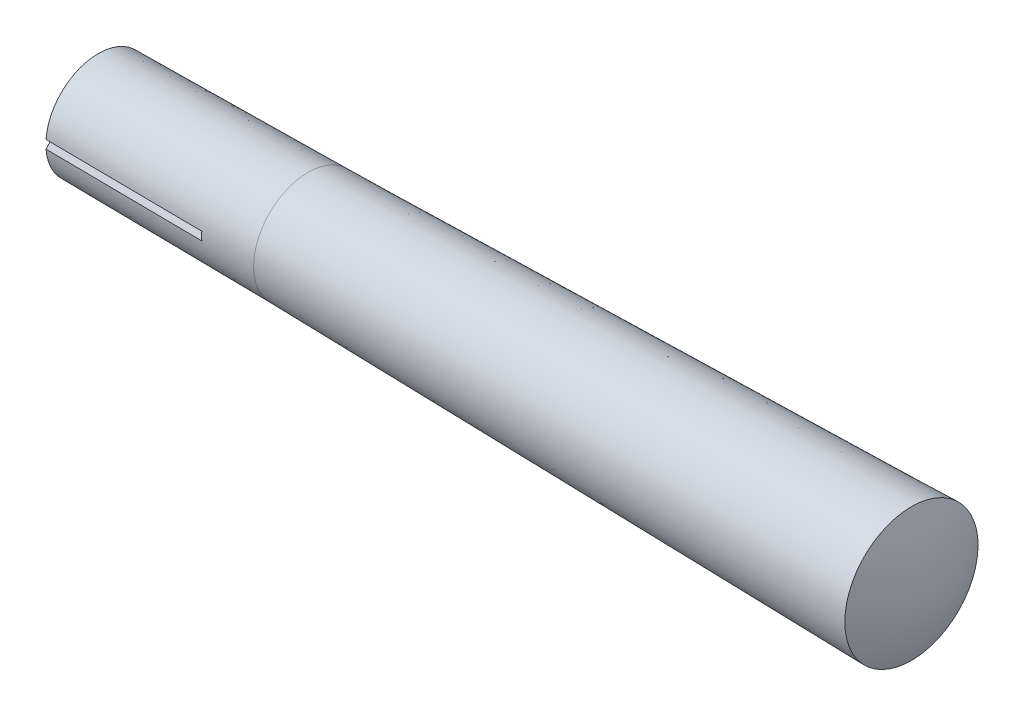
ISO-10303-21;
HEADER;
FILE_DESCRIPTION(('STEP AP214'),'2;1');
FILE_NAME('part.step','',(''),(''),'','','');
FILE_SCHEMA(('AUTOMOTIVE_DESIGN { 1 0 10303 214 1 1 1 1 }'));
ENDSEC;
DATA;
#1=APPLICATION_CONTEXT('core data for automotive mechanical design processes');
#2=APPLICATION_PROTOCOL_DEFINITION('international standard','automotive_design',2000,#1);
#3=PRODUCT_CONTEXT('',#1,'mechanical');
#4=PRODUCT('Part','Part','',(#3));
#5=PRODUCT_RELATED_PRODUCT_CATEGORY('part','',(#4));
#6=PRODUCT_DEFINITION_FORMATION('','',#4);
#7=PRODUCT_DEFINITION_CONTEXT('part definition',#1,'design');
#8=PRODUCT_DEFINITION('design','',#6,#7);
#9=PRODUCT_DEFINITION_SHAPE('','',#8);
#10=(LENGTH_UNIT() NAMED_UNIT(*) SI_UNIT(.MILLI.,.METRE.));
#11=(NAMED_UNIT(*) PLANE_ANGLE_UNIT() SI_UNIT($,.RADIAN.));
#12=(NAMED_UNIT(*) SI_UNIT($,.STERADIAN.) SOLID_ANGLE_UNIT());
#13=UNCERTAINTY_MEASURE_WITH_UNIT(LENGTH_MEASURE(1.E-05),#10,'distance_accuracy_value','');
#14=(GEOMETRIC_REPRESENTATION_CONTEXT(3) GLOBAL_UNCERTAINTY_ASSIGNED_CONTEXT((#13)) GLOBAL_UNIT_ASSIGNED_CONTEXT((#10,
#11,#12)) REPRESENTATION_CONTEXT('',''));
#15=CARTESIAN_POINT('',(0.,0.,0.));
#16=DIRECTION('',(0.,0.,1.));
#17=DIRECTION('',(1.,0.,0.));
#18=AXIS2_PLACEMENT_3D('',#15,#16,#17);
#19=CARTESIAN_POINT('',(17.4975488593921,0.,0.));
#20=DIRECTION('',(-1.,0.,0.));
#21=DIRECTION('',(0.,0.,1.));
#22=AXIS2_PLACEMENT_3D('',#19,#20,#21);
#23=DEGENERATE_TOROIDAL_SURFACE('',#22,0.313112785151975,20.,.T.);
#24=CARTESIAN_POINT('',(0.,0.,0.));
#25=DIRECTION('',(-1.,0.,0.));
#26=DIRECTION('',(0.,0.,1.));
#27=AXIS2_PLACEMENT_3D('',#24,#25,#26);
#28=CIRCLE('',#27,10.);
#29=CARTESIAN_POINT('',(0.,0.799999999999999,9.96794863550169));
#30=VERTEX_POINT('',#29);
#31=CARTESIAN_POINT('',(0.,0.800000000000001,-9.96794863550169));
#32=VERTEX_POINT('',#31);
#33=EDGE_CURVE('E101',#30,#32,#28,.T.);
#34=ORIENTED_EDGE('',*,*,#33,.T.);
#35=CARTESIAN_POINT('',(-2.49652378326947,0.8,0.));
#36=CARTESIAN_POINT('',(-2.49652432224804,0.8,0.133371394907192));
#37=CARTESIAN_POINT('',(-2.49574079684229,0.8,0.266735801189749));
#38=CARTESIAN_POINT('',(-2.49225916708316,0.8,0.533450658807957));
#39=CARTESIAN_POINT('',(-2.48956098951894,0.8,0.666801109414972));
#40=CARTESIAN_POINT('',(-2.48183007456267,0.8,0.933885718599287));
#41=CARTESIAN_POINT('',(-2.47678949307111,0.8,1.06761965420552));
#42=CARTESIAN_POINT('',(-2.46419580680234,0.8,1.33496952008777));
#43=CARTESIAN_POINT('',(-2.45664267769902,0.8,1.4685854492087));
#44=CARTESIAN_POINT('',(-2.43008825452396,0.8,1.86918413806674));
#45=CARTESIAN_POINT('',(-2.40719186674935,0.8,2.13591991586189));
#46=CARTESIAN_POINT('',(-2.35079475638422,0.8,2.66848639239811));
#47=CARTESIAN_POINT('',(-2.31728549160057,0.8,2.93431618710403));
#48=CARTESIAN_POINT('',(-2.23966533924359,0.8,3.46444745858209));
#49=CARTESIAN_POINT('',(-2.19555267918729,0.799999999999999,3.72874867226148));
#50=CARTESIAN_POINT('',(-2.04613311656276,0.799999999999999,4.52519992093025));
#51=CARTESIAN_POINT('',(-1.92442685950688,0.799999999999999,5.05441151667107));
#52=CARTESIAN_POINT('',(-1.70995864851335,0.799999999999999,5.83936475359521));
#53=CARTESIAN_POINT('',(-1.63313069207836,0.799999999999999,6.0995947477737));
#54=CARTESIAN_POINT('',(-1.46893599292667,0.799999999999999,6.61677714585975));
#55=CARTESIAN_POINT('',(-1.38156703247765,0.799999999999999,6.87372884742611));
#56=CARTESIAN_POINT('',(-1.10365696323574,0.799999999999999,7.6395207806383));
#57=CARTESIAN_POINT('',(-0.897457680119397,0.799999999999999,8.14276717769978));
#58=CARTESIAN_POINT('',(-0.444736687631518,0.799999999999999,9.13079494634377));
#59=CARTESIAN_POINT('',(-0.198214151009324,0.799999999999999,9.61557593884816));
#60=CARTESIAN_POINT('',(0.205178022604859,0.799999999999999,10.3347096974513));
#61=CARTESIAN_POINT('',(0.347936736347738,0.799999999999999,10.5770685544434));
#62=CARTESIAN_POINT('',(0.643513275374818,0.799999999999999,11.055488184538));
#63=CARTESIAN_POINT('',(0.796328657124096,0.799999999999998,11.2915504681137));
#64=CARTESIAN_POINT('',(1.26956012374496,0.799999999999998,11.9898041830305));
#65=CARTESIAN_POINT('',(1.60477707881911,0.799999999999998,12.4420901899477));
#66=CARTESIAN_POINT('',(2.31200697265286,0.799999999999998,13.3165963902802));
#67=CARTESIAN_POINT('',(2.68400905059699,0.799999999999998,13.7388253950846));
#68=CARTESIAN_POINT('',(3.46228921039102,0.799999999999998,14.5504331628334));
#69=CARTESIAN_POINT('',(3.86856689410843,0.799999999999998,14.9398123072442));
#70=CARTESIAN_POINT('',(4.71222453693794,0.799999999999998,15.6826920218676));
#71=CARTESIAN_POINT('',(5.14958426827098,0.799999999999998,16.0362155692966));
#72=CARTESIAN_POINT('',(6.05253330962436,0.799999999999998,16.7051626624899));
#73=CARTESIAN_POINT('',(6.51812268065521,0.799999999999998,17.020586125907));
#74=CARTESIAN_POINT('',(7.47424959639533,0.799999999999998,17.6111065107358));
#75=CARTESIAN_POINT('',(7.96478873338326,0.799999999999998,17.8862008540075));
#76=CARTESIAN_POINT('',(8.96729980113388,0.799999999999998,18.3940829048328));
#77=CARTESIAN_POINT('',(9.47927172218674,0.799999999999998,18.6268706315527));
#78=CARTESIAN_POINT('',(10.5209617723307,0.799999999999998,19.048465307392));
#79=CARTESIAN_POINT('',(11.050678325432,0.799999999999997,19.2372761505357));
#80=CARTESIAN_POINT('',(12.1241346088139,0.799999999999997,19.5696010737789));
#81=CARTESIAN_POINT('',(12.6678743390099,0.799999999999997,19.7131151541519));
#82=CARTESIAN_POINT('',(13.765500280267,0.799999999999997,19.9538237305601));
#83=CARTESIAN_POINT('',(14.3193862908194,0.799999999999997,20.0510191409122));
#84=CARTESIAN_POINT('',(15.4333774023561,0.799999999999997,20.1984035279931));
#85=CARTESIAN_POINT('',(15.9934825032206,0.799999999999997,20.2485925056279));
#86=CARTESIAN_POINT('',(17.1159178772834,0.799999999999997,20.3016066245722));
#87=CARTESIAN_POINT('',(17.6782481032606,0.799999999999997,20.3044327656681));
#88=CARTESIAN_POINT('',(18.8011477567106,0.799999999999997,20.2627036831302));
#89=CARTESIAN_POINT('',(19.3617171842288,0.799999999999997,20.2181484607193));
#90=CARTESIAN_POINT('',(20.4771283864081,0.799999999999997,20.0819711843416));
#91=CARTESIAN_POINT('',(21.0319699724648,0.799999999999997,19.990347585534));
#92=CARTESIAN_POINT('',(22.1319621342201,0.799999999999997,19.7606841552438));
#93=CARTESIAN_POINT('',(22.6771127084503,0.799999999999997,19.6226443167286));
#94=CARTESIAN_POINT('',(23.753871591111,0.799999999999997,19.3011225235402));
#95=CARTESIAN_POINT('',(24.2854792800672,0.799999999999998,19.117638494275));
#96=CARTESIAN_POINT('',(25.3313465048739,0.799999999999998,18.7065363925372));
#97=CARTESIAN_POINT('',(25.8456060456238,0.799999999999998,18.478918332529));
#98=CARTESIAN_POINT('',(26.8530566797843,0.799999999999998,17.9811981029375));
#99=CARTESIAN_POINT('',(27.3462504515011,0.799999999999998,17.7111013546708));
#100=CARTESIAN_POINT('',(28.3081327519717,0.799999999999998,17.1303242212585));
#101=CARTESIAN_POINT('',(28.7768212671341,0.799999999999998,16.8196438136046));
#102=CARTESIAN_POINT('',(29.6862924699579,0.799999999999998,16.1599557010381));
#103=CARTESIAN_POINT('',(30.1270796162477,0.799999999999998,15.8109541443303));
#104=CARTESIAN_POINT('',(30.97768189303,0.799999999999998,15.077084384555));
#105=CARTESIAN_POINT('',(31.3874970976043,0.799999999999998,14.6922162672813));
#106=CARTESIAN_POINT('',(32.173483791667,0.799999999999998,13.8890869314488));
#107=CARTESIAN_POINT('',(32.5496395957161,0.799999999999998,13.4708103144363));
#108=CARTESIAN_POINT('',(33.0863346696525,0.799999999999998,12.8208857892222));
#109=CARTESIAN_POINT('',(33.2606514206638,0.799999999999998,12.6004808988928));
#110=CARTESIAN_POINT('',(33.5998857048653,0.799999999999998,12.152461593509));
#111=CARTESIAN_POINT('',(33.7648008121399,0.799999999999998,11.9248453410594));
#112=CARTESIAN_POINT('',(34.2450384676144,0.799999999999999,11.2316916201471));
#113=CARTESIAN_POINT('',(34.5457800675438,0.799999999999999,10.7559379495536));
#114=CARTESIAN_POINT('',(35.1060738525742,0.799999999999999,9.78076711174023));
#115=CARTESIAN_POINT('',(35.3656261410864,0.799999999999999,9.28135000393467));
#116=CARTESIAN_POINT('',(35.7224861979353,0.799999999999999,8.51762358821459));
#117=CARTESIAN_POINT('',(35.8359708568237,0.799999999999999,8.26077021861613));
#118=CARTESIAN_POINT('',(36.0519976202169,0.799999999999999,7.74258165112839));
#119=CARTESIAN_POINT('',(36.1545424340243,0.799999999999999,7.48124758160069));
#120=CARTESIAN_POINT('',(36.4455469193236,0.799999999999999,6.69104432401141));
#121=CARTESIAN_POINT('',(36.6173960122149,0.799999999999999,6.15593260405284));
#122=CARTESIAN_POINT('',(36.8919965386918,0.799999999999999,5.15850154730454));
#123=CARTESIAN_POINT('',(37.0013654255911,0.799999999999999,4.69797559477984));
#124=CARTESIAN_POINT('',(37.1871913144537,0.799999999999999,3.77047016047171));
#125=CARTESIAN_POINT('',(37.2636631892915,0.8,3.30349369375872));
#126=CARTESIAN_POINT('',(37.3536072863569,0.8,2.59959399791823));
#127=CARTESIAN_POINT('',(37.3794729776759,0.8,2.3641834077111));
#128=CARTESIAN_POINT('',(37.4229504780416,0.8,1.89260512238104));
#129=CARTESIAN_POINT('',(37.4405629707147,0.8,1.65643749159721));
#130=CARTESIAN_POINT('',(37.4609542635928,0.8,1.30177924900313));
#131=CARTESIAN_POINT('',(37.4667477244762,0.8,1.18345199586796));
#132=CARTESIAN_POINT('',(37.4764027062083,0.8,0.946718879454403));
#133=CARTESIAN_POINT('',(37.4802642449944,0.8,0.828313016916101));
#134=CARTESIAN_POINT('',(37.486213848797,0.8,0.591438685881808));
#135=CARTESIAN_POINT('',(37.4883016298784,0.8,0.472970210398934));
#136=CARTESIAN_POINT('',(37.4910058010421,0.8,0.23601716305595));
#137=CARTESIAN_POINT('',(37.4916221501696,0.8,0.117532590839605));
#138=CARTESIAN_POINT('',(37.4916198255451,0.8,-0.298511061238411));
#139=CARTESIAN_POINT('',(37.4877271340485,0.8,-0.59609674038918));
#140=CARTESIAN_POINT('',(37.4729961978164,0.8,-1.04216106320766));
#141=CARTESIAN_POINT('',(37.4666046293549,0.8,-1.19078684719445));
#142=CARTESIAN_POINT('',(37.4506729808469,0.8,-1.48787008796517));
#143=CARTESIAN_POINT('',(37.441132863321,0.8,-1.63632754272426));
#144=CARTESIAN_POINT('',(37.4076775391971,0.8,-2.08116851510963));
#145=CARTESIAN_POINT('',(37.3789215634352,0.8,-2.37720445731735));
#146=CARTESIAN_POINT('',(37.308331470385,0.8,-2.96773997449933));
#147=CARTESIAN_POINT('',(37.2664957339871,0.8,-3.26223935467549));
#148=CARTESIAN_POINT('',(37.1698359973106,0.8,-3.84871616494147));
#149=CARTESIAN_POINT('',(37.1150288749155,0.800000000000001,-4.14069636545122));
#150=CARTESIAN_POINT('',(36.9924926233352,0.800000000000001,-4.7218963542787));
#151=CARTESIAN_POINT('',(36.9247640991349,0.800000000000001,-5.01111627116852));
#152=CARTESIAN_POINT('',(36.7022926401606,0.800000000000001,-5.87406854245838));
#153=CARTESIAN_POINT('',(36.5282863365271,0.800000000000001,-6.44295681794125));
#154=CARTESIAN_POINT('',(36.1321100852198,0.800000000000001,-7.5578503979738));
#155=CARTESIAN_POINT('',(35.9103941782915,0.800000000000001,-8.10401715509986));
#156=CARTESIAN_POINT('',(35.542434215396,0.800000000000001,-8.90678748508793));
#157=CARTESIAN_POINT('',(35.4138890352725,0.800000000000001,-9.17162074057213));
#158=CARTESIAN_POINT('',(35.1451950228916,0.800000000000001,-9.69542974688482));
#159=CARTESIAN_POINT('',(35.0050428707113,0.800000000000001,-9.95440379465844));
#160=CARTESIAN_POINT('',(34.567363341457,0.800000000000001,-10.7221072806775));
#161=CARTESIAN_POINT('',(34.2527859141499,0.800000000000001,-11.2212406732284));
#162=CARTESIAN_POINT('',(33.5807516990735,0.800000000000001,-12.1897443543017));
#163=CARTESIAN_POINT('',(33.2232957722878,0.800000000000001,-12.6591152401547));
#164=CARTESIAN_POINT('',(32.6658613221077,0.800000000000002,-13.3275821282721));
#165=CARTESIAN_POINT('',(32.4812755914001,0.800000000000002,-13.5396668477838));
#166=CARTESIAN_POINT('',(32.1033777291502,0.800000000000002,-13.9558061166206));
#167=CARTESIAN_POINT('',(31.9100680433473,0.800000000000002,-14.1598628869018));
#168=CARTESIAN_POINT('',(31.3174624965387,0.800000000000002,-14.7595410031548));
#169=CARTESIAN_POINT('',(30.905439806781,0.800000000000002,-15.1427305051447));
#170=CARTESIAN_POINT('',(30.0508524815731,0.800000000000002,-15.8727699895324));
#171=CARTESIAN_POINT('',(29.6083046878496,0.800000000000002,-16.2196397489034));
#172=CARTESIAN_POINT('',(28.6955427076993,0.800000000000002,-16.8748873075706));
#173=CARTESIAN_POINT('',(28.2253281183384,0.800000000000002,-17.1832645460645));
#174=CARTESIAN_POINT('',(27.2605909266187,0.800000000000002,-17.7593142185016));
#175=CARTESIAN_POINT('',(26.7660679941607,0.800000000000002,-18.0269860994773));
#176=CARTESIAN_POINT('',(25.7562326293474,0.800000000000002,-18.5197211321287));
#177=CARTESIAN_POINT('',(25.2409202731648,0.800000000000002,-18.7447844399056));
#178=CARTESIAN_POINT('',(24.1930805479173,0.800000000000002,-19.150736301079));
#179=CARTESIAN_POINT('',(23.6605503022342,0.800000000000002,-19.331617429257));
#180=CARTESIAN_POINT('',(22.5821430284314,0.800000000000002,-19.6478701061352));
#181=CARTESIAN_POINT('',(22.0362659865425,0.800000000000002,-19.7832416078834));
#182=CARTESIAN_POINT('',(20.9350958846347,0.800000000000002,-20.0075021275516));
#183=CARTESIAN_POINT('',(20.3798036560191,0.800000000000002,-20.0963952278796));
#184=CARTESIAN_POINT('',(19.263704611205,0.800000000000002,-20.2270849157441));
#185=CARTESIAN_POINT('',(18.7028977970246,0.800000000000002,-20.2688815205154));
#186=CARTESIAN_POINT('',(17.5797830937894,0.800000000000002,-20.3050802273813));
#187=CARTESIAN_POINT('',(17.0174752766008,0.800000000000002,-20.2994845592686));
#188=CARTESIAN_POINT('',(15.8953297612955,0.800000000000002,-20.2409438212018));
#189=CARTESIAN_POINT('',(15.3354920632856,0.800000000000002,-20.1879987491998));
#190=CARTESIAN_POINT('',(14.2222671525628,0.800000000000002,-20.0351356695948));
#191=CARTESIAN_POINT('',(13.6688799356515,0.800000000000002,-19.9352176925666));
#192=CARTESIAN_POINT('',(12.5724897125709,0.800000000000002,-19.6891192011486));
#193=CARTESIAN_POINT('',(12.0294867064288,0.800000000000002,-19.5429386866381));
#194=CARTESIAN_POINT('',(10.9577058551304,0.800000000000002,-19.205348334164));
#195=CARTESIAN_POINT('',(10.4289285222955,0.800000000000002,-19.0139368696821));
#196=CARTESIAN_POINT('',(9.38937867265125,0.800000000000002,-18.5872484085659));
#197=CARTESIAN_POINT('',(8.87860615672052,0.800000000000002,-18.3519714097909));
#198=CARTESIAN_POINT('',(7.87867052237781,0.800000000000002,-17.8392110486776));
#199=CARTESIAN_POINT('',(7.38950855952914,0.800000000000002,-17.561725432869));
#200=CARTESIAN_POINT('',(6.43630090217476,0.800000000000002,-16.9665301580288));
#201=CARTESIAN_POINT('',(5.97225521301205,0.800000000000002,-16.6488204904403));
#202=CARTESIAN_POINT('',(5.07264064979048,0.800000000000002,-15.975482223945));
#203=CARTESIAN_POINT('',(4.63706791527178,0.800000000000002,-15.6198587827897));
#204=CARTESIAN_POINT('',(3.79742677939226,0.800000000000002,-14.8731862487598));
#205=CARTESIAN_POINT('',(3.39335832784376,0.800000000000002,-14.4821372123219));
#206=CARTESIAN_POINT('',(2.61967763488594,0.800000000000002,-13.667478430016));
#207=CARTESIAN_POINT('',(2.25005820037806,0.800000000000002,-13.2438755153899));
#208=CARTESIAN_POINT('',(1.54780314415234,0.800000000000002,-12.3670449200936));
#209=CARTESIAN_POINT('',(1.21516775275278,0.800000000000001,-11.9138170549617));
#210=CARTESIAN_POINT('',(0.589058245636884,0.800000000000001,-10.9806812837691));
#211=CARTESIAN_POINT('',(0.295607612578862,0.800000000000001,-10.5007576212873));
#212=CARTESIAN_POINT('',(-0.24980662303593,0.800000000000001,-9.51790494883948));
#213=CARTESIAN_POINT('',(-0.501771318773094,0.800000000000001,-9.01497654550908));
#214=CARTESIAN_POINT('',(-0.962635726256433,0.800000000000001,-7.9892398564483));
#215=CARTESIAN_POINT('',(-1.17149809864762,0.800000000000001,-7.46641479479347));
#216=CARTESIAN_POINT('',(-1.54442877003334,0.800000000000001,-6.40495382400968));
#217=CARTESIAN_POINT('',(-1.70849184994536,0.800000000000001,-5.86631608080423));
#218=CARTESIAN_POINT('',(-1.990359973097,0.800000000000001,-4.77829430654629));
#219=CARTESIAN_POINT('',(-2.10826142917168,0.800000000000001,-4.22893521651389));
#220=CARTESIAN_POINT('',(-2.29749527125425,0.8,-3.12248330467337));
#221=CARTESIAN_POINT('',(-2.3688506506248,0.8,-2.56539444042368));
#222=CARTESIAN_POINT('',(-2.44572472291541,0.8,-1.6727855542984));
#223=CARTESIAN_POINT('',(-2.46618779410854,0.8,-1.3384755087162));
#224=CARTESIAN_POINT('',(-2.49158345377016,0.8,-0.669428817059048));
#225=CARTESIAN_POINT('',(-2.49652243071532,0.8,-0.334692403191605));
#226=CARTESIAN_POINT('',(-2.49652378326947,0.8,0.));
#227=B_SPLINE_CURVE_WITH_KNOTS('',3,(#35,#36,#37,#38,#39,#40,#41,#42,#43,#44,#45,#46,#47,#48,
#49,#50,#51,#52,#53,#54,#55,#56,#57,#58,#59,#60,#61,#62,#63,#64,#65,#66,#67,#68,#69,#70,#71,#72,
#73,#74,#75,#76,#77,#78,#79,#80,#81,#82,#83,#84,#85,#86,#87,#88,#89,#90,#91,#92,#93,#94,#95,#96,
#97,#98,#99,#100,#101,#102,#103,#104,#105,#106,#107,#108,#109,#110,#111,#112,#113,#114,#115,
#116,#117,#118,#119,#120,#121,#122,#123,#124,#125,#126,#127,#128,#129,#130,#131,#132,#133,#134,
#135,#136,#137,#138,#139,#140,#141,#142,#143,#144,#145,#146,#147,#148,#149,#150,#151,#152,#153,
#154,#155,#156,#157,#158,#159,#160,#161,#162,#163,#164,#165,#166,#167,#168,#169,#170,#171,#172,
#173,#174,#175,#176,#177,#178,#179,#180,#181,#182,#183,#184,#185,#186,#187,#188,#189,#190,#191,
#192,#193,#194,#195,#196,#197,#198,#199,#200,#201,#202,#203,#204,#205,#206,#207,#208,#209,#210,
#211,#212,#213,#214,#215,#216,#217,#218,#219,#220,#221,#222,#223,#224,#225,#226),.UNSPECIFIED.,
.T.,.F.,(4,2,2,2,2,2,2,2,2,2,2,2,2,2,2,2,2,2,2,2,2,2,2,2,2,2,2,2,2,2,2,2,2,2,2,2,2,2,2,2,2,2,2,
2,2,2,2,2,2,2,2,2,2,2,2,2,2,2,2,2,2,2,2,2,2,2,2,2,2,2,2,2,2,2,2,2,2,2,2,2,2,2,2,2,2,2,2,2,2,2,2,
2,2,2,2,4),(0.,0.400098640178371,0.800212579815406,1.2016761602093,1.60314362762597,
2.40607221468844,3.20964872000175,4.01335964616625,5.6402930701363,6.45411794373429,
7.26811433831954,8.89775246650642,10.527424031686,11.3710379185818,12.2144475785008,
13.9011718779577,15.5873996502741,17.2736078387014,18.9587285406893,20.6438528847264,
22.3290849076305,24.0143161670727,25.6993981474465,27.3844801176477,29.0695288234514,
30.7545774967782,32.4395906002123,34.1246036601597,35.8096720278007,37.494740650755,
39.1798862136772,40.8650313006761,42.5499614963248,44.2348926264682,45.919553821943,
47.6042109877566,49.289649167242,50.1324539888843,50.9754753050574,52.6618621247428,
54.3482447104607,55.1904445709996,56.0324353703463,57.7162800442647,59.1351995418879,
60.5534768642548,61.2638439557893,61.9741521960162,62.3295465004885,62.6849375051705,
63.0403853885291,63.3958431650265,64.288477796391,64.7347352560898,65.1809980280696,
66.0729723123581,66.9650570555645,67.8559873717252,68.7468759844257,70.5290670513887,
72.2949935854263,73.1778865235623,74.0610328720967,75.8285666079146,77.5960648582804,
78.4393337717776,79.2823677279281,80.9682006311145,82.6531107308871,84.3380453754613,
86.0230029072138,87.7079542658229,89.39318860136,91.0784246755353,92.7635127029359,
94.4486001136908,96.1336082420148,97.8186164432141,99.5036235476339,101.18863065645,
102.873698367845,104.558766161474,106.243923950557,107.929082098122,109.614011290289,
111.298937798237,112.983511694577,114.66809608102,116.353685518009,118.039230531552,
119.726229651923,121.413425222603,123.097077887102,124.779898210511,125.784349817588,
126.788388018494),.UNSPECIFIED.);
#228=EDGE_CURVE('E67',#32,#30,#227,.T.);
#229=ORIENTED_EDGE('',*,*,#228,.T.);
#230=EDGE_LOOP('',(#34,#229));
#231=FACE_BOUND('',#230,.T.);
#232=ADVANCED_FACE('F39',(#231),#23,.T.);
#233=CARTESIAN_POINT('',(0.,-0.799999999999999,-9.96794863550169));
#234=VERTEX_POINT('',#233);
#235=CARTESIAN_POINT('',(0.,-0.800000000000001,9.96794863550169));
#236=VERTEX_POINT('',#235);
#237=EDGE_CURVE('E104',#234,#236,#28,.T.);
#238=ORIENTED_EDGE('',*,*,#237,.T.);
#239=CARTESIAN_POINT('',(-2.49652378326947,-0.8,0.));
#240=CARTESIAN_POINT('',(-2.49652432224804,-0.8,-0.133371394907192));
#241=CARTESIAN_POINT('',(-2.49574079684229,-0.8,-0.266735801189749));
#242=CARTESIAN_POINT('',(-2.49225916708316,-0.8,-0.533450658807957));
#243=CARTESIAN_POINT('',(-2.48956098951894,-0.8,-0.666801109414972));
#244=CARTESIAN_POINT('',(-2.48183007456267,-0.8,-0.933885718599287));
#245=CARTESIAN_POINT('',(-2.47678949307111,-0.8,-1.06761965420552));
#246=CARTESIAN_POINT('',(-2.46419580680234,-0.8,-1.33496952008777));
#247=CARTESIAN_POINT('',(-2.45664267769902,-0.8,-1.4685854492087));
#248=CARTESIAN_POINT('',(-2.43008825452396,-0.8,-1.86918413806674));
#249=CARTESIAN_POINT('',(-2.40719186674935,-0.8,-2.13591991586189));
#250=CARTESIAN_POINT('',(-2.35079475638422,-0.8,-2.66848639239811));
#251=CARTESIAN_POINT('',(-2.31728549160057,-0.8,-2.93431618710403));
#252=CARTESIAN_POINT('',(-2.23966533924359,-0.8,-3.46444745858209));
#253=CARTESIAN_POINT('',(-2.19555267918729,-0.8,-3.72874867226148));
#254=CARTESIAN_POINT('',(-2.04613311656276,-0.8,-4.52519992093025));
#255=CARTESIAN_POINT('',(-1.92442685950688,-0.8,-5.05441151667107));
#256=CARTESIAN_POINT('',(-1.70995864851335,-0.799999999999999,-5.83936475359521));
#257=CARTESIAN_POINT('',(-1.63313069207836,-0.799999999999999,-6.0995947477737));
#258=CARTESIAN_POINT('',(-1.46893599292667,-0.799999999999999,-6.61677714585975));
#259=CARTESIAN_POINT('',(-1.38156703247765,-0.799999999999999,-6.87372884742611));
#260=CARTESIAN_POINT('',(-1.10365696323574,-0.799999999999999,-7.6395207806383));
#261=CARTESIAN_POINT('',(-0.897457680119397,-0.799999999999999,-8.14276717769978));
#262=CARTESIAN_POINT('',(-0.444736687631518,-0.799999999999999,-9.13079494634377));
#263=CARTESIAN_POINT('',(-0.198214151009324,-0.799999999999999,-9.61557593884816));
#264=CARTESIAN_POINT('',(0.205178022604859,-0.799999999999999,-10.3347096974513));
#265=CARTESIAN_POINT('',(0.347936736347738,-0.799999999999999,-10.5770685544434));
#266=CARTESIAN_POINT('',(0.643513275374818,-0.799999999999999,-11.055488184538));
#267=CARTESIAN_POINT('',(0.796328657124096,-0.799999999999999,-11.2915504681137));
#268=CARTESIAN_POINT('',(1.26956012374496,-0.799999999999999,-11.9898041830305));
#269=CARTESIAN_POINT('',(1.60477707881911,-0.799999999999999,-12.4420901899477));
#270=CARTESIAN_POINT('',(2.31200697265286,-0.799999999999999,-13.3165963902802));
#271=CARTESIAN_POINT('',(2.68400905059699,-0.799999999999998,-13.7388253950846));
#272=CARTESIAN_POINT('',(3.46228921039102,-0.799999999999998,-14.5504331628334));
#273=CARTESIAN_POINT('',(3.86856689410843,-0.799999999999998,-14.9398123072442));
#274=CARTESIAN_POINT('',(4.71222453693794,-0.799999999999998,-15.6826920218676));
#275=CARTESIAN_POINT('',(5.14958426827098,-0.799999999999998,-16.0362155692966));
#276=CARTESIAN_POINT('',(6.05253330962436,-0.799999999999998,-16.7051626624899));
#277=CARTESIAN_POINT('',(6.51812268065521,-0.799999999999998,-17.020586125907));
#278=CARTESIAN_POINT('',(7.47424959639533,-0.799999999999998,-17.6111065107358));
#279=CARTESIAN_POINT('',(7.96478873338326,-0.799999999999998,-17.8862008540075));
#280=CARTESIAN_POINT('',(8.96729980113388,-0.799999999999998,-18.3940829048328));
#281=CARTESIAN_POINT('',(9.47927172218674,-0.799999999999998,-18.6268706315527));
#282=CARTESIAN_POINT('',(10.5209617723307,-0.799999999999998,-19.048465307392));
#283=CARTESIAN_POINT('',(11.050678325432,-0.799999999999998,-19.2372761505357));
#284=CARTESIAN_POINT('',(12.1241346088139,-0.799999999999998,-19.5696010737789));
#285=CARTESIAN_POINT('',(12.6678743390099,-0.799999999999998,-19.7131151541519));
#286=CARTESIAN_POINT('',(13.765500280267,-0.799999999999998,-19.9538237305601));
#287=CARTESIAN_POINT('',(14.3193862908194,-0.799999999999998,-20.0510191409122));
#288=CARTESIAN_POINT('',(15.4333774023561,-0.799999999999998,-20.1984035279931));
#289=CARTESIAN_POINT('',(15.9934825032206,-0.799999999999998,-20.2485925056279));
#290=CARTESIAN_POINT('',(17.1159178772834,-0.799999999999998,-20.3016066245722));
#291=CARTESIAN_POINT('',(17.6782481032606,-0.799999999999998,-20.3044327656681));
#292=CARTESIAN_POINT('',(18.8011477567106,-0.799999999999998,-20.2627036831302));
#293=CARTESIAN_POINT('',(19.3617171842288,-0.799999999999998,-20.2181484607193));
#294=CARTESIAN_POINT('',(20.4771283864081,-0.799999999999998,-20.0819711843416));
#295=CARTESIAN_POINT('',(21.0319699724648,-0.799999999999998,-19.990347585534));
#296=CARTESIAN_POINT('',(22.1319621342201,-0.799999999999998,-19.7606841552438));
#297=CARTESIAN_POINT('',(22.6771127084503,-0.799999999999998,-19.6226443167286));
#298=CARTESIAN_POINT('',(23.753871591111,-0.799999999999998,-19.3011225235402));
#299=CARTESIAN_POINT('',(24.2854792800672,-0.799999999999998,-19.117638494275));
#300=CARTESIAN_POINT('',(25.3313465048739,-0.799999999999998,-18.7065363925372));
#301=CARTESIAN_POINT('',(25.8456060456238,-0.799999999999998,-18.478918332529));
#302=CARTESIAN_POINT('',(26.8530566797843,-0.799999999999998,-17.9811981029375));
#303=CARTESIAN_POINT('',(27.3462504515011,-0.799999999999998,-17.7111013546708));
#304=CARTESIAN_POINT('',(28.3081327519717,-0.799999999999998,-17.1303242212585));
#305=CARTESIAN_POINT('',(28.7768212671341,-0.799999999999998,-16.8196438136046));
#306=CARTESIAN_POINT('',(29.6862924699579,-0.799999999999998,-16.1599557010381));
#307=CARTESIAN_POINT('',(30.1270796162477,-0.799999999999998,-15.8109541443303));
#308=CARTESIAN_POINT('',(30.97768189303,-0.799999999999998,-15.077084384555));
#309=CARTESIAN_POINT('',(31.3874970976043,-0.799999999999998,-14.6922162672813));
#310=CARTESIAN_POINT('',(32.173483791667,-0.799999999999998,-13.8890869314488));
#311=CARTESIAN_POINT('',(32.5496395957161,-0.799999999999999,-13.4708103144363));
#312=CARTESIAN_POINT('',(33.0863346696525,-0.799999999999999,-12.8208857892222));
#313=CARTESIAN_POINT('',(33.2606514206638,-0.799999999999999,-12.6004808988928));
#314=CARTESIAN_POINT('',(33.5998857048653,-0.799999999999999,-12.152461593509));
#315=CARTESIAN_POINT('',(33.7648008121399,-0.799999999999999,-11.9248453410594));
#316=CARTESIAN_POINT('',(34.2450384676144,-0.799999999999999,-11.2316916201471));
#317=CARTESIAN_POINT('',(34.5457800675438,-0.799999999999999,-10.7559379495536));
#318=CARTESIAN_POINT('',(35.1060738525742,-0.799999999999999,-9.78076711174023));
#319=CARTESIAN_POINT('',(35.3656261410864,-0.799999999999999,-9.28135000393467));
#320=CARTESIAN_POINT('',(35.7224861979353,-0.799999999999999,-8.51762358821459));
#321=CARTESIAN_POINT('',(35.8359708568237,-0.799999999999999,-8.26077021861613));
#322=CARTESIAN_POINT('',(36.0519976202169,-0.799999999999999,-7.74258165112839));
#323=CARTESIAN_POINT('',(36.1545424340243,-0.799999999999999,-7.48124758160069));
#324=CARTESIAN_POINT('',(36.4455469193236,-0.799999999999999,-6.69104432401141));
#325=CARTESIAN_POINT('',(36.6173960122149,-0.799999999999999,-6.15593260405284));
#326=CARTESIAN_POINT('',(36.8919965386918,-0.799999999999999,-5.15850154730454));
#327=CARTESIAN_POINT('',(37.0013654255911,-0.8,-4.69797559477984));
#328=CARTESIAN_POINT('',(37.1871913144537,-0.8,-3.77047016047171));
#329=CARTESIAN_POINT('',(37.2636631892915,-0.8,-3.30349369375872));
#330=CARTESIAN_POINT('',(37.3536072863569,-0.8,-2.59959399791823));
#331=CARTESIAN_POINT('',(37.3794729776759,-0.8,-2.3641834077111));
#332=CARTESIAN_POINT('',(37.4229504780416,-0.8,-1.89260512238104));
#333=CARTESIAN_POINT('',(37.4405629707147,-0.8,-1.65643749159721));
#334=CARTESIAN_POINT('',(37.4609542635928,-0.8,-1.30177924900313));
#335=CARTESIAN_POINT('',(37.4667477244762,-0.8,-1.18345199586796));
#336=CARTESIAN_POINT('',(37.4764027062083,-0.8,-0.946718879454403));
#337=CARTESIAN_POINT('',(37.4802642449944,-0.8,-0.828313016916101));
#338=CARTESIAN_POINT('',(37.486213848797,-0.8,-0.591438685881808));
#339=CARTESIAN_POINT('',(37.4883016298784,-0.8,-0.472970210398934));
#340=CARTESIAN_POINT('',(37.4910058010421,-0.8,-0.23601716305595));
#341=CARTESIAN_POINT('',(37.4916221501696,-0.8,-0.117532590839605));
#342=CARTESIAN_POINT('',(37.4916198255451,-0.8,0.298511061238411));
#343=CARTESIAN_POINT('',(37.4877271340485,-0.8,0.59609674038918));
#344=CARTESIAN_POINT('',(37.4729961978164,-0.8,1.04216106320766));
#345=CARTESIAN_POINT('',(37.4666046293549,-0.8,1.19078684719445));
#346=CARTESIAN_POINT('',(37.4506729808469,-0.8,1.48787008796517));
#347=CARTESIAN_POINT('',(37.441132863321,-0.8,1.63632754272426));
#348=CARTESIAN_POINT('',(37.4076775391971,-0.8,2.08116851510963));
#349=CARTESIAN_POINT('',(37.3789215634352,-0.8,2.37720445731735));
#350=CARTESIAN_POINT('',(37.308331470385,-0.8,2.96773997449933));
#351=CARTESIAN_POINT('',(37.2664957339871,-0.800000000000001,3.26223935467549));
#352=CARTESIAN_POINT('',(37.1698359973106,-0.800000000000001,3.84871616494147));
#353=CARTESIAN_POINT('',(37.1150288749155,-0.800000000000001,4.14069636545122));
#354=CARTESIAN_POINT('',(36.9924926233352,-0.800000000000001,4.7218963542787));
#355=CARTESIAN_POINT('',(36.9247640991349,-0.800000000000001,5.01111627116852));
#356=CARTESIAN_POINT('',(36.7022926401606,-0.800000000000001,5.87406854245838));
#357=CARTESIAN_POINT('',(36.5282863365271,-0.800000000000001,6.44295681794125));
#358=CARTESIAN_POINT('',(36.1321100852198,-0.800000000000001,7.5578503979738));
#359=CARTESIAN_POINT('',(35.9103941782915,-0.800000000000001,8.10401715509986));
#360=CARTESIAN_POINT('',(35.542434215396,-0.800000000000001,8.90678748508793));
#361=CARTESIAN_POINT('',(35.4138890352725,-0.800000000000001,9.17162074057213));
#362=CARTESIAN_POINT('',(35.1451950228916,-0.800000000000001,9.69542974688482));
#363=CARTESIAN_POINT('',(35.0050428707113,-0.800000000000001,9.95440379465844));
#364=CARTESIAN_POINT('',(34.567363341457,-0.800000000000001,10.7221072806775));
#365=CARTESIAN_POINT('',(34.2527859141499,-0.800000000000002,11.2212406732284));
#366=CARTESIAN_POINT('',(33.5807516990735,-0.800000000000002,12.1897443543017));
#367=CARTESIAN_POINT('',(33.2232957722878,-0.800000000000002,12.6591152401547));
#368=CARTESIAN_POINT('',(32.6658613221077,-0.800000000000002,13.3275821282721));
#369=CARTESIAN_POINT('',(32.4812755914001,-0.800000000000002,13.5396668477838));
#370=CARTESIAN_POINT('',(32.1033777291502,-0.800000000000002,13.9558061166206));
#371=CARTESIAN_POINT('',(31.9100680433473,-0.800000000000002,14.1598628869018));
#372=CARTESIAN_POINT('',(31.3174624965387,-0.800000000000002,14.7595410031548));
#373=CARTESIAN_POINT('',(30.905439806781,-0.800000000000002,15.1427305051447));
#374=CARTESIAN_POINT('',(30.0508524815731,-0.800000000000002,15.8727699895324));
#375=CARTESIAN_POINT('',(29.6083046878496,-0.800000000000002,16.2196397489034));
#376=CARTESIAN_POINT('',(28.6955427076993,-0.800000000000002,16.8748873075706));
#377=CARTESIAN_POINT('',(28.2253281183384,-0.800000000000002,17.1832645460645));
#378=CARTESIAN_POINT('',(27.2605909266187,-0.800000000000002,17.7593142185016));
#379=CARTESIAN_POINT('',(26.7660679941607,-0.800000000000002,18.0269860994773));
#380=CARTESIAN_POINT('',(25.7562326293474,-0.800000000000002,18.5197211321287));
#381=CARTESIAN_POINT('',(25.2409202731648,-0.800000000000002,18.7447844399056));
#382=CARTESIAN_POINT('',(24.1930805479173,-0.800000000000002,19.150736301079));
#383=CARTESIAN_POINT('',(23.6605503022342,-0.800000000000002,19.331617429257));
#384=CARTESIAN_POINT('',(22.5821430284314,-0.800000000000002,19.6478701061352));
#385=CARTESIAN_POINT('',(22.0362659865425,-0.800000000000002,19.7832416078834));
#386=CARTESIAN_POINT('',(20.9350958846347,-0.800000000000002,20.0075021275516));
#387=CARTESIAN_POINT('',(20.3798036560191,-0.800000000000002,20.0963952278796));
#388=CARTESIAN_POINT('',(19.263704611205,-0.800000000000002,20.2270849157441));
#389=CARTESIAN_POINT('',(18.7028977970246,-0.800000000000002,20.2688815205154));
#390=CARTESIAN_POINT('',(17.5797830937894,-0.800000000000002,20.3050802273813));
#391=CARTESIAN_POINT('',(17.0174752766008,-0.800000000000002,20.2994845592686));
#392=CARTESIAN_POINT('',(15.8953297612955,-0.800000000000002,20.2409438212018));
#393=CARTESIAN_POINT('',(15.3354920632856,-0.800000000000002,20.1879987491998));
#394=CARTESIAN_POINT('',(14.2222671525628,-0.800000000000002,20.0351356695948));
#395=CARTESIAN_POINT('',(13.6688799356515,-0.800000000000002,19.9352176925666));
#396=CARTESIAN_POINT('',(12.5724897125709,-0.800000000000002,19.6891192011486));
#397=CARTESIAN_POINT('',(12.0294867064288,-0.800000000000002,19.5429386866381));
#398=CARTESIAN_POINT('',(10.9577058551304,-0.800000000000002,19.205348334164));
#399=CARTESIAN_POINT('',(10.4289285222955,-0.800000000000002,19.0139368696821));
#400=CARTESIAN_POINT('',(9.38937867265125,-0.800000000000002,18.5872484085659));
#401=CARTESIAN_POINT('',(8.87860615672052,-0.800000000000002,18.3519714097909));
#402=CARTESIAN_POINT('',(7.87867052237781,-0.800000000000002,17.8392110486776));
#403=CARTESIAN_POINT('',(7.38950855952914,-0.800000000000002,17.561725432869));
#404=CARTESIAN_POINT('',(6.43630090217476,-0.800000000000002,16.9665301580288));
#405=CARTESIAN_POINT('',(5.97225521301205,-0.800000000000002,16.6488204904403));
#406=CARTESIAN_POINT('',(5.07264064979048,-0.800000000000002,15.975482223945));
#407=CARTESIAN_POINT('',(4.63706791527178,-0.800000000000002,15.6198587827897));
#408=CARTESIAN_POINT('',(3.79742677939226,-0.800000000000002,14.8731862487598));
#409=CARTESIAN_POINT('',(3.39335832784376,-0.800000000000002,14.4821372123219));
#410=CARTESIAN_POINT('',(2.61967763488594,-0.800000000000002,13.667478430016));
#411=CARTESIAN_POINT('',(2.25005820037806,-0.800000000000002,13.2438755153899));
#412=CARTESIAN_POINT('',(1.54780314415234,-0.800000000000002,12.3670449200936));
#413=CARTESIAN_POINT('',(1.21516775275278,-0.800000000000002,11.9138170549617));
#414=CARTESIAN_POINT('',(0.589058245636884,-0.800000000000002,10.9806812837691));
#415=CARTESIAN_POINT('',(0.295607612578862,-0.800000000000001,10.5007576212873));
#416=CARTESIAN_POINT('',(-0.24980662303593,-0.800000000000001,9.51790494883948));
#417=CARTESIAN_POINT('',(-0.501771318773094,-0.800000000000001,9.01497654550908));
#418=CARTESIAN_POINT('',(-0.962635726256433,-0.800000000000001,7.9892398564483));
#419=CARTESIAN_POINT('',(-1.17149809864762,-0.800000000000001,7.46641479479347));
#420=CARTESIAN_POINT('',(-1.54442877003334,-0.800000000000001,6.40495382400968));
#421=CARTESIAN_POINT('',(-1.70849184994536,-0.800000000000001,5.86631608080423));
#422=CARTESIAN_POINT('',(-1.990359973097,-0.800000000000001,4.77829430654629));
#423=CARTESIAN_POINT('',(-2.10826142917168,-0.800000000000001,4.22893521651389));
#424=CARTESIAN_POINT('',(-2.29749527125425,-0.8,3.12248330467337));
#425=CARTESIAN_POINT('',(-2.3688506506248,-0.8,2.56539444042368));
#426=CARTESIAN_POINT('',(-2.44572472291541,-0.8,1.6727855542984));
#427=CARTESIAN_POINT('',(-2.46618779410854,-0.8,1.3384755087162));
#428=CARTESIAN_POINT('',(-2.49158345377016,-0.8,0.669428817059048));
#429=CARTESIAN_POINT('',(-2.49652243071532,-0.8,0.334692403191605));
#430=CARTESIAN_POINT('',(-2.49652378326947,-0.8,0.));
#431=B_SPLINE_CURVE_WITH_KNOTS('',3,(#239,#240,#241,#242,#243,#244,#245,#246,#247,#248,#249,
#250,#251,#252,#253,#254,#255,#256,#257,#258,#259,#260,#261,#262,#263,#264,#265,#266,#267,#268,
#269,#270,#271,#272,#273,#274,#275,#276,#277,#278,#279,#280,#281,#282,#283,#284,#285,#286,#287,
#288,#289,#290,#291,#292,#293,#294,#295,#296,#297,#298,#299,#300,#301,#302,#303,#304,#305,#306,
#307,#308,#309,#310,#311,#312,#313,#314,#315,#316,#317,#318,#319,#320,#321,#322,#323,#324,#325,
#326,#327,#328,#329,#330,#331,#332,#333,#334,#335,#336,#337,#338,#339,#340,#341,#342,#343,#344,
#345,#346,#347,#348,#349,#350,#351,#352,#353,#354,#355,#356,#357,#358,#359,#360,#361,#362,#363,
#364,#365,#366,#367,#368,#369,#370,#371,#372,#373,#374,#375,#376,#377,#378,#379,#380,#381,#382,
#383,#384,#385,#386,#387,#388,#389,#390,#391,#392,#393,#394,#395,#396,#397,#398,#399,#400,#401,
#402,#403,#404,#405,#406,#407,#408,#409,#410,#411,#412,#413,#414,#415,#416,#417,#418,#419,#420,
#421,#422,#423,#424,#425,#426,#427,#428,#429,#430),.UNSPECIFIED.,.T.,.F.,(4,2,2,2,2,2,2,2,2,2,2,
2,2,2,2,2,2,2,2,2,2,2,2,2,2,2,2,2,2,2,2,2,2,2,2,2,2,2,2,2,2,2,2,2,2,2,2,2,2,2,2,2,2,2,2,2,2,2,2,
2,2,2,2,2,2,2,2,2,2,2,2,2,2,2,2,2,2,2,2,2,2,2,2,2,2,2,2,2,2,2,2,2,2,2,2,4),(0.,
0.400098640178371,0.800212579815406,1.2016761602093,1.60314362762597,2.40607221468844,
3.20964872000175,4.01335964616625,5.6402930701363,6.45411794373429,7.26811433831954,
8.89775246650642,10.527424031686,11.3710379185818,12.2144475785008,13.9011718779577,
15.5873996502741,17.2736078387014,18.9587285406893,20.6438528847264,22.3290849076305,
24.0143161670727,25.6993981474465,27.3844801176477,29.0695288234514,30.7545774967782,
32.4395906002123,34.1246036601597,35.8096720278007,37.494740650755,39.1798862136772,
40.8650313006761,42.5499614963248,44.2348926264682,45.919553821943,47.6042109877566,
49.289649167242,50.1324539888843,50.9754753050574,52.6618621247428,54.3482447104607,
55.1904445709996,56.0324353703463,57.7162800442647,59.1351995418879,60.5534768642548,
61.2638439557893,61.9741521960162,62.3295465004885,62.6849375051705,63.0403853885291,
63.3958431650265,64.288477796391,64.7347352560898,65.1809980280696,66.0729723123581,
66.9650570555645,67.8559873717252,68.7468759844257,70.5290670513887,72.2949935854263,
73.1778865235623,74.0610328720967,75.8285666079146,77.5960648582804,78.4393337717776,
79.2823677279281,80.9682006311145,82.6531107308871,84.3380453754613,86.0230029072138,
87.7079542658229,89.39318860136,91.0784246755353,92.7635127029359,94.4486001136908,
96.1336082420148,97.8186164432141,99.5036235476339,101.18863065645,102.873698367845,
104.558766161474,106.243923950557,107.929082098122,109.614011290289,111.298937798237,
112.983511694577,114.66809608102,116.353685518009,118.039230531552,119.726229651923,
121.413425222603,123.097077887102,124.779898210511,125.784349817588,126.788388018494),.UNSPECIFIED.);
#432=EDGE_CURVE('E148',#236,#234,#431,.T.);
#433=ORIENTED_EDGE('',*,*,#432,.T.);
#434=EDGE_LOOP('',(#238,#433));
#435=FACE_BOUND('',#434,.T.);
#436=ADVANCED_FACE('F147',(#435),#23,.T.);
#437=CARTESIAN_POINT('',(123.866429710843,0.,0.));
#438=DIRECTION('',(-1.,0.,0.));
#439=DIRECTION('',(0.,1.,0.));
#440=AXIS2_PLACEMENT_3D('',#437,#438,#439);
#441=SPHERICAL_SURFACE('',#440,33.6335702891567);
#442=CARTESIAN_POINT('',(155.01,0.,0.));
#443=DIRECTION('',(-1.,0.,0.));
#444=DIRECTION('',(0.,0.,1.));
#445=AXIS2_PLACEMENT_3D('',#442,#443,#444);
#446=CIRCLE('',#445,12.7002);
#447=CARTESIAN_POINT('',(155.01,0.,12.7002));
#448=VERTEX_POINT('',#447);
#449=EDGE_CURVE('E107',#448,#448,#446,.T.);
#450=ORIENTED_EDGE('',*,*,#449,.F.);
#451=EDGE_LOOP('',(#450));
#452=FACE_BOUND('',#451,.T.);
#453=ADVANCED_FACE('F158',(#452),#441,.T.);
#454=CARTESIAN_POINT('',(155.01,0.,0.));
#455=DIRECTION('',(1.,0.,0.));
#456=DIRECTION('',(0.,0.,-1.));
#457=AXIS2_PLACEMENT_3D('',#454,#455,#456);
#458=CONICAL_SURFACE('',#457,12.7002,0.0199973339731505);
#459=CARTESIAN_POINT('',(40.,0.,0.));
#460=DIRECTION('',(-1.,0.,0.));
#461=DIRECTION('',(0.,0.,1.));
#462=AXIS2_PLACEMENT_3D('',#459,#460,#461);
#463=CIRCLE('',#462,10.4);
#464=CARTESIAN_POINT('',(40.,0.,10.4));
#465=VERTEX_POINT('',#464);
#466=EDGE_CURVE('E103',#465,#465,#463,.T.);
#467=ORIENTED_EDGE('',*,*,#466,.F.);
#468=EDGE_LOOP('',(#467));
#469=FACE_BOUND('',#468,.T.);
#470=ORIENTED_EDGE('',*,*,#449,.T.);
#471=EDGE_LOOP('',(#470));
#472=FACE_BOUND('',#471,.T.);
#473=ADVANCED_FACE('F163',(#469,#472),#458,.T.);
#474=CARTESIAN_POINT('',(40.,0.,0.));
#475=DIRECTION('',(1.,0.,0.));
#476=DIRECTION('',(0.,0.,-1.));
#477=AXIS2_PLACEMENT_3D('',#474,#475,#476);
#478=CONICAL_SURFACE('',#477,10.4,0.00999966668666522);
#479=ORIENTED_EDGE('',*,*,#33,.F.);
#480=CARTESIAN_POINT('',(-16.1469757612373,0.799999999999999,9.80595111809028));
#481=CARTESIAN_POINT('',(-9.52203970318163,0.799999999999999,9.87242056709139));
#482=CARTESIAN_POINT('',(-2.89710360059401,0.799999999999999,9.93888557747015));
#483=CARTESIAN_POINT('',(10.3527686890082,0.799999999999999,10.0718071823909));
#484=CARTESIAN_POINT('',(16.9777048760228,0.799999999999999,10.1382637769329));
#485=CARTESIAN_POINT('',(46.9896001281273,0.799999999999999,10.4393035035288));
#486=CARTESIAN_POINT('',(70.3765596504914,0.799999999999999,10.6738410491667));
#487=CARTESIAN_POINT('',(93.7635195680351,0.799999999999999,10.9083391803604));
#488=B_SPLINE_CURVE_WITH_KNOTS('',3,(#480,#481,#482,#483,#484,#485,#486,#487),.UNSPECIFIED.,.F.,
.F.,(4,2,2,4),(0.,19.8758085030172,39.751617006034,109.916023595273),.UNSPECIFIED.);
#489=CARTESIAN_POINT('',(30.,0.799999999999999,10.268885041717));
#490=VERTEX_POINT('',#489);
#491=EDGE_CURVE('E11',#30,#490,#488,.T.);
#492=ORIENTED_EDGE('',*,*,#491,.T.);
#493=CARTESIAN_POINT('',(30.,0.,0.));
#494=DIRECTION('',(1.,0.,0.));
#495=DIRECTION('',(0.,0.,-1.));
#496=AXIS2_PLACEMENT_3D('',#493,#494,#495);
#497=CIRCLE('',#496,10.3);
#498=CARTESIAN_POINT('',(30.,-0.800000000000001,10.268885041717));
#499=VERTEX_POINT('',#498);
#500=EDGE_CURVE('E85',#490,#499,#497,.T.);
#501=ORIENTED_EDGE('',*,*,#500,.T.);
#502=CARTESIAN_POINT('',(-16.1469757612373,-0.800000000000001,9.80595111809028));
#503=CARTESIAN_POINT('',(-9.52203970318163,-0.800000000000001,9.87242056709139));
#504=CARTESIAN_POINT('',(-2.89710360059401,-0.800000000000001,9.93888557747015));
#505=CARTESIAN_POINT('',(10.3527686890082,-0.800000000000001,10.0718071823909));
#506=CARTESIAN_POINT('',(16.9777048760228,-0.800000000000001,10.1382637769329));
#507=CARTESIAN_POINT('',(46.9896001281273,-0.800000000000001,10.4393035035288));
#508=CARTESIAN_POINT('',(70.3765596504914,-0.800000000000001,10.6738410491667));
#509=CARTESIAN_POINT('',(93.7635195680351,-0.800000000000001,10.9083391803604));
#510=B_SPLINE_CURVE_WITH_KNOTS('',3,(#502,#503,#504,#505,#506,#507,#508,#509),.UNSPECIFIED.,.F.,
.F.,(4,2,2,4),(0.,19.8758085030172,39.751617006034,109.916023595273),.UNSPECIFIED.);
#511=EDGE_CURVE('E53',#499,#236,#510,.F.);
#512=ORIENTED_EDGE('',*,*,#511,.T.);
#513=ORIENTED_EDGE('',*,*,#237,.F.);
#514=CARTESIAN_POINT('',(-16.1469757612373,-0.799999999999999,-9.80595111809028));
#515=CARTESIAN_POINT('',(-9.52203970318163,-0.799999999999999,-9.87242056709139));
#516=CARTESIAN_POINT('',(-2.89710360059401,-0.799999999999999,-9.93888557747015));
#517=CARTESIAN_POINT('',(10.3527686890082,-0.799999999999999,-10.0718071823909));
#518=CARTESIAN_POINT('',(16.9777048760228,-0.799999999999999,-10.1382637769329));
#519=CARTESIAN_POINT('',(46.9896001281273,-0.799999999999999,-10.4393035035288));
#520=CARTESIAN_POINT('',(70.3765596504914,-0.799999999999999,-10.6738410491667));
#521=CARTESIAN_POINT('',(93.7635195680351,-0.799999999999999,-10.9083391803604));
#522=B_SPLINE_CURVE_WITH_KNOTS('',3,(#514,#515,#516,#517,#518,#519,#520,#521),.UNSPECIFIED.,.F.,
.F.,(4,2,2,4),(0.,19.8758085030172,39.751617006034,109.916023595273),.UNSPECIFIED.);
#523=CARTESIAN_POINT('',(30.,-0.799999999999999,-10.268885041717));
#524=VERTEX_POINT('',#523);
#525=EDGE_CURVE('E118',#234,#524,#522,.T.);
#526=ORIENTED_EDGE('',*,*,#525,.T.);
#527=CARTESIAN_POINT('',(30.,0.800000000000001,-10.268885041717));
#528=VERTEX_POINT('',#527);
#529=EDGE_CURVE('E93',#524,#528,#497,.T.);
#530=ORIENTED_EDGE('',*,*,#529,.T.);
#531=CARTESIAN_POINT('',(-16.1469757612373,0.800000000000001,-9.80595111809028));
#532=CARTESIAN_POINT('',(-9.52203970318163,0.800000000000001,-9.87242056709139));
#533=CARTESIAN_POINT('',(-2.89710360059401,0.800000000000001,-9.93888557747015));
#534=CARTESIAN_POINT('',(10.3527686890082,0.800000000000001,-10.0718071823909));
#535=CARTESIAN_POINT('',(16.9777048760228,0.800000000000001,-10.1382637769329));
#536=CARTESIAN_POINT('',(46.9896001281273,0.800000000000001,-10.4393035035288));
#537=CARTESIAN_POINT('',(70.3765596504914,0.800000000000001,-10.6738410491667));
#538=CARTESIAN_POINT('',(93.7635195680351,0.800000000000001,-10.9083391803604));
#539=B_SPLINE_CURVE_WITH_KNOTS('',3,(#531,#532,#533,#534,#535,#536,#537,#538),.UNSPECIFIED.,.F.,
.F.,(4,2,2,4),(0.,19.8758085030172,39.751617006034,109.916023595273),.UNSPECIFIED.);
#540=EDGE_CURVE('E91',#528,#32,#539,.F.);
#541=ORIENTED_EDGE('',*,*,#540,.T.);
#542=EDGE_LOOP('',(#479,#492,#501,#512,#513,#526,#530,#541));
#543=FACE_BOUND('',#542,.T.);
#544=ORIENTED_EDGE('',*,*,#466,.T.);
#545=EDGE_LOOP('',(#544));
#546=FACE_BOUND('',#545,.T.);
#547=ADVANCED_FACE('F98',(#543,#546),#478,.T.);
#548=CARTESIAN_POINT('',(-2.5024511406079,0.800000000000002,-12.7002));
#549=DIRECTION('',(0.,1.,0.));
#550=DIRECTION('',(0.,0.,1.));
#551=AXIS2_PLACEMENT_3D('',#548,#549,#550);
#552=PLANE('',#551);
#553=DIRECTION('',(0.,0.,1.));
#554=VECTOR('',#553,1.);
#555=CARTESIAN_POINT('',(30.,0.800000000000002,-12.7002));
#556=LINE('',#555,#554);
#557=EDGE_CURVE('E60',#528,#490,#556,.T.);
#558=ORIENTED_EDGE('',*,*,#557,.T.);
#559=ORIENTED_EDGE('',*,*,#491,.F.);
#560=ORIENTED_EDGE('',*,*,#228,.F.);
#561=ORIENTED_EDGE('',*,*,#540,.F.);
#562=EDGE_LOOP('',(#558,#559,#560,#561));
#563=FACE_BOUND('',#562,.T.);
#564=ADVANCED_FACE('F94',(#563),#552,.F.);
#565=CARTESIAN_POINT('',(-2.5024511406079,-0.799999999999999,-12.7002));
#566=DIRECTION('',(0.,-1.,0.));
#567=DIRECTION('',(0.,0.,-1.));
#568=AXIS2_PLACEMENT_3D('',#565,#566,#567);
#569=PLANE('',#568);
#570=ORIENTED_EDGE('',*,*,#432,.F.);
#571=ORIENTED_EDGE('',*,*,#511,.F.);
#572=DIRECTION('',(0.,0.,-1.));
#573=VECTOR('',#572,1.);
#574=CARTESIAN_POINT('',(30.,-0.799999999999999,-12.7002));
#575=LINE('',#574,#573);
#576=EDGE_CURVE('E88',#499,#524,#575,.T.);
#577=ORIENTED_EDGE('',*,*,#576,.T.);
#578=ORIENTED_EDGE('',*,*,#525,.F.);
#579=EDGE_LOOP('',(#570,#571,#577,#578));
#580=FACE_BOUND('',#579,.T.);
#581=ADVANCED_FACE('F132',(#580),#569,.F.);
#582=CARTESIAN_POINT('',(30.,0.800000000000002,-12.7002));
#583=DIRECTION('',(1.,0.,0.));
#584=DIRECTION('',(0.,0.,-1.));
#585=AXIS2_PLACEMENT_3D('',#582,#583,#584);
#586=PLANE('',#585);
#587=ORIENTED_EDGE('',*,*,#557,.F.);
#588=ORIENTED_EDGE('',*,*,#529,.F.);
#589=ORIENTED_EDGE('',*,*,#576,.F.);
#590=ORIENTED_EDGE('',*,*,#500,.F.);
#591=EDGE_LOOP('',(#587,#588,#589,#590));
#592=FACE_BOUND('',#591,.T.);
#593=ADVANCED_FACE('F86',(#592),#586,.F.);
#594=CLOSED_SHELL('',(#232,#436,#453,#473,#547,#564,#581,#593));
#595=MANIFOLD_SOLID_BREP('B2',#594);
#596=ADVANCED_BREP_SHAPE_REPRESENTATION('',(#18,#595),#14);
#597=SHAPE_DEFINITION_REPRESENTATION(#9,#596);
ENDSEC;
END-ISO-10303-21;
